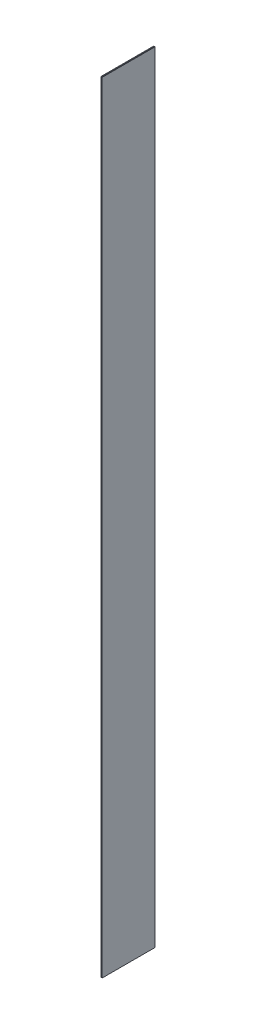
ISO-10303-21;
HEADER;
FILE_DESCRIPTION(('STEP AP214'),'2;1');
FILE_NAME('part.step','',(''),(''),'','','');
FILE_SCHEMA(('AUTOMOTIVE_DESIGN { 1 0 10303 214 1 1 1 1 }'));
ENDSEC;
DATA;
#1=APPLICATION_CONTEXT('core data for automotive mechanical design processes');
#2=APPLICATION_PROTOCOL_DEFINITION('international standard','automotive_design',2000,#1);
#3=PRODUCT_CONTEXT('',#1,'mechanical');
#4=PRODUCT('Part','Part','',(#3));
#5=PRODUCT_RELATED_PRODUCT_CATEGORY('part','',(#4));
#6=PRODUCT_DEFINITION_FORMATION('','',#4);
#7=PRODUCT_DEFINITION_CONTEXT('part definition',#1,'design');
#8=PRODUCT_DEFINITION('design','',#6,#7);
#9=PRODUCT_DEFINITION_SHAPE('','',#8);
#10=(LENGTH_UNIT() NAMED_UNIT(*) SI_UNIT(.MILLI.,.METRE.));
#11=(NAMED_UNIT(*) PLANE_ANGLE_UNIT() SI_UNIT($,.RADIAN.));
#12=(NAMED_UNIT(*) SI_UNIT($,.STERADIAN.) SOLID_ANGLE_UNIT());
#13=UNCERTAINTY_MEASURE_WITH_UNIT(LENGTH_MEASURE(1.E-05),#10,'distance_accuracy_value','');
#14=(GEOMETRIC_REPRESENTATION_CONTEXT(3) GLOBAL_UNCERTAINTY_ASSIGNED_CONTEXT((#13)) GLOBAL_UNIT_ASSIGNED_CONTEXT((#10,
#11,#12)) REPRESENTATION_CONTEXT('',''));
#15=CARTESIAN_POINT('',(0.,0.,0.));
#16=DIRECTION('',(0.,0.,1.));
#17=DIRECTION('',(1.,0.,0.));
#18=AXIS2_PLACEMENT_3D('',#15,#16,#17);
#19=CARTESIAN_POINT('',(-9.52499999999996,11255.781,381.));
#20=DIRECTION('',(1.,0.,0.));
#21=DIRECTION('',(0.,0.,-1.));
#22=AXIS2_PLACEMENT_3D('',#19,#20,#21);
#23=PLANE('',#22);
#24=DIRECTION('',(0.,-1.,0.));
#25=VECTOR('',#24,1.);
#26=CARTESIAN_POINT('',(-9.52499999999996,11255.781,381.));
#27=LINE('',#26,#25);
#28=CARTESIAN_POINT('',(-9.52499999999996,11249.781,381.));
#29=VERTEX_POINT('',#28);
#30=CARTESIAN_POINT('',(-9.52499999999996,6.00000000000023,381.));
#31=VERTEX_POINT('',#30);
#32=EDGE_CURVE('E139',#29,#31,#27,.T.);
#33=ORIENTED_EDGE('',*,*,#32,.F.);
#34=DIRECTION('',(0.,0.,-1.));
#35=VECTOR('',#34,1.);
#36=CARTESIAN_POINT('',(-9.52500000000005,11249.781,-381.));
#37=LINE('',#36,#35);
#38=CARTESIAN_POINT('',(-9.52500000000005,11249.781,-381.));
#39=VERTEX_POINT('',#38);
#40=EDGE_CURVE('E166',#29,#39,#37,.T.);
#41=ORIENTED_EDGE('',*,*,#40,.T.);
#42=DIRECTION('',(0.,-1.,0.));
#43=VECTOR('',#42,1.);
#44=CARTESIAN_POINT('',(-9.52500000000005,11255.781,-381.));
#45=LINE('',#44,#43);
#46=CARTESIAN_POINT('',(-9.52500000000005,6.00000000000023,-381.));
#47=VERTEX_POINT('',#46);
#48=EDGE_CURVE('E189',#39,#47,#45,.T.);
#49=ORIENTED_EDGE('',*,*,#48,.T.);
#50=DIRECTION('',(0.,0.,1.));
#51=VECTOR('',#50,1.);
#52=CARTESIAN_POINT('',(-9.52499999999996,6.00000000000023,381.));
#53=LINE('',#52,#51);
#54=EDGE_CURVE('E167',#47,#31,#53,.T.);
#55=ORIENTED_EDGE('',*,*,#54,.T.);
#56=EDGE_LOOP('',(#33,#41,#49,#55));
#57=FACE_BOUND('',#56,.T.);
#58=ADVANCED_FACE('F50',(#57),#23,.F.);
#59=CARTESIAN_POINT('',(9.52500000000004,11255.781,381.));
#60=DIRECTION('',(0.,0.,-1.));
#61=DIRECTION('',(-1.,0.,0.));
#62=AXIS2_PLACEMENT_3D('',#59,#60,#61);
#63=PLANE('',#62);
#64=DIRECTION('',(0.,-1.,0.));
#65=VECTOR('',#64,1.);
#66=CARTESIAN_POINT('',(9.52500000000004,11255.781,381.));
#67=LINE('',#66,#65);
#68=CARTESIAN_POINT('',(9.52500000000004,11249.781,381.));
#69=VERTEX_POINT('',#68);
#70=CARTESIAN_POINT('',(9.52500000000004,6.00000000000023,381.));
#71=VERTEX_POINT('',#70);
#72=EDGE_CURVE('E343',#69,#71,#67,.T.);
#73=ORIENTED_EDGE('',*,*,#72,.F.);
#74=DIRECTION('',(-1.,0.,0.));
#75=VECTOR('',#74,1.);
#76=CARTESIAN_POINT('',(-9.52499999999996,11249.781,381.));
#77=LINE('',#76,#75);
#78=EDGE_CURVE('E162',#69,#29,#77,.T.);
#79=ORIENTED_EDGE('',*,*,#78,.T.);
#80=ORIENTED_EDGE('',*,*,#32,.T.);
#81=DIRECTION('',(1.,0.,0.));
#82=VECTOR('',#81,1.);
#83=CARTESIAN_POINT('',(9.52500000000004,6.00000000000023,381.));
#84=LINE('',#83,#82);
#85=EDGE_CURVE('E157',#31,#71,#84,.T.);
#86=ORIENTED_EDGE('',*,*,#85,.T.);
#87=EDGE_LOOP('',(#73,#79,#80,#86));
#88=FACE_BOUND('',#87,.T.);
#89=ADVANCED_FACE('F230',(#88),#63,.F.);
#90=CARTESIAN_POINT('',(9.52500000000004,11255.781,381.));
#91=DIRECTION('',(-1.,0.,0.));
#92=DIRECTION('',(0.,0.,1.));
#93=AXIS2_PLACEMENT_3D('',#90,#91,#92);
#94=PLANE('',#93);
#95=DIRECTION('',(0.,-1.,0.));
#96=VECTOR('',#95,1.);
#97=CARTESIAN_POINT('',(9.52499999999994,11255.781,-381.));
#98=LINE('',#97,#96);
#99=CARTESIAN_POINT('',(9.52499999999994,11249.781,-381.));
#100=VERTEX_POINT('',#99);
#101=CARTESIAN_POINT('',(9.52499999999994,6.00000000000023,-381.));
#102=VERTEX_POINT('',#101);
#103=EDGE_CURVE('E336',#100,#102,#98,.T.);
#104=ORIENTED_EDGE('',*,*,#103,.F.);
#105=DIRECTION('',(0.,0.,1.));
#106=VECTOR('',#105,1.);
#107=CARTESIAN_POINT('',(9.52500000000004,11249.781,381.));
#108=LINE('',#107,#106);
#109=EDGE_CURVE('E156',#100,#69,#108,.T.);
#110=ORIENTED_EDGE('',*,*,#109,.T.);
#111=ORIENTED_EDGE('',*,*,#72,.T.);
#112=DIRECTION('',(0.,0.,-1.));
#113=VECTOR('',#112,1.);
#114=CARTESIAN_POINT('',(9.52500000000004,6.00000000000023,381.));
#115=LINE('',#114,#113);
#116=EDGE_CURVE('E153',#71,#102,#115,.T.);
#117=ORIENTED_EDGE('',*,*,#116,.T.);
#118=EDGE_LOOP('',(#104,#110,#111,#117));
#119=FACE_BOUND('',#118,.T.);
#120=ADVANCED_FACE('F233',(#119),#94,.F.);
#121=CARTESIAN_POINT('',(9.52499999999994,11255.781,-381.));
#122=DIRECTION('',(0.,0.,1.));
#123=DIRECTION('',(1.,0.,0.));
#124=AXIS2_PLACEMENT_3D('',#121,#122,#123);
#125=PLANE('',#124);
#126=ORIENTED_EDGE('',*,*,#48,.F.);
#127=DIRECTION('',(1.,0.,0.));
#128=VECTOR('',#127,1.);
#129=CARTESIAN_POINT('',(9.52499999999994,11249.781,-381.));
#130=LINE('',#129,#128);
#131=EDGE_CURVE('E124',#39,#100,#130,.T.);
#132=ORIENTED_EDGE('',*,*,#131,.T.);
#133=ORIENTED_EDGE('',*,*,#103,.T.);
#134=DIRECTION('',(-1.,0.,0.));
#135=VECTOR('',#134,1.);
#136=CARTESIAN_POINT('',(9.52499999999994,6.00000000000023,-381.));
#137=LINE('',#136,#135);
#138=EDGE_CURVE('E141',#102,#47,#137,.T.);
#139=ORIENTED_EDGE('',*,*,#138,.T.);
#140=EDGE_LOOP('',(#126,#132,#133,#139));
#141=FACE_BOUND('',#140,.T.);
#142=ADVANCED_FACE('F221',(#141),#125,.F.);
#143=CARTESIAN_POINT('',(0.,11255.781,0.));
#144=DIRECTION('',(0.,1.,0.));
#145=DIRECTION('',(0.,0.,1.));
#146=AXIS2_PLACEMENT_3D('',#143,#144,#145);
#147=PLANE('',#146);
#148=DIRECTION('',(0.,0.,-1.));
#149=VECTOR('',#148,1.);
#150=CARTESIAN_POINT('',(3.52499999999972,11255.781,-381.));
#151=LINE('',#150,#149);
#152=CARTESIAN_POINT('',(3.52499999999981,11255.781,375.));
#153=VERTEX_POINT('',#152);
#154=CARTESIAN_POINT('',(3.52499999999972,11255.781,-375.));
#155=VERTEX_POINT('',#154);
#156=EDGE_CURVE('E137',#153,#155,#151,.T.);
#157=ORIENTED_EDGE('',*,*,#156,.T.);
#158=DIRECTION('',(-1.,0.,0.));
#159=VECTOR('',#158,1.);
#160=CARTESIAN_POINT('',(-9.52500000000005,11255.781,-375.));
#161=LINE('',#160,#159);
#162=CARTESIAN_POINT('',(-3.52499999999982,11255.781,-375.));
#163=VERTEX_POINT('',#162);
#164=EDGE_CURVE('E116',#155,#163,#161,.T.);
#165=ORIENTED_EDGE('',*,*,#164,.T.);
#166=DIRECTION('',(0.,0.,1.));
#167=VECTOR('',#166,1.);
#168=CARTESIAN_POINT('',(-3.52499999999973,11255.781,381.));
#169=LINE('',#168,#167);
#170=CARTESIAN_POINT('',(-3.52499999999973,11255.781,375.));
#171=VERTEX_POINT('',#170);
#172=EDGE_CURVE('E126',#163,#171,#169,.T.);
#173=ORIENTED_EDGE('',*,*,#172,.T.);
#174=DIRECTION('',(1.,0.,0.));
#175=VECTOR('',#174,1.);
#176=CARTESIAN_POINT('',(9.52500000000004,11255.781,375.));
#177=LINE('',#176,#175);
#178=EDGE_CURVE('E133',#171,#153,#177,.T.);
#179=ORIENTED_EDGE('',*,*,#178,.T.);
#180=EDGE_LOOP('',(#157,#165,#173,#179));
#181=FACE_BOUND('',#180,.T.);
#182=ADVANCED_FACE('F140',(#181),#147,.T.);
#183=CARTESIAN_POINT('',(0.,0.,0.));
#184=DIRECTION('',(0.,1.,0.));
#185=DIRECTION('',(0.,0.,1.));
#186=AXIS2_PLACEMENT_3D('',#183,#184,#185);
#187=PLANE('',#186);
#188=DIRECTION('',(0.,0.,1.));
#189=VECTOR('',#188,1.);
#190=CARTESIAN_POINT('',(3.52499999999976,0.,0.));
#191=LINE('',#190,#189);
#192=CARTESIAN_POINT('',(3.52499999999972,0.,-375.));
#193=VERTEX_POINT('',#192);
#194=CARTESIAN_POINT('',(3.52499999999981,0.,375.));
#195=VERTEX_POINT('',#194);
#196=EDGE_CURVE('E59',#193,#195,#191,.T.);
#197=ORIENTED_EDGE('',*,*,#196,.T.);
#198=DIRECTION('',(-1.,0.,0.));
#199=VECTOR('',#198,1.);
#200=CARTESIAN_POINT('',(0.,0.,375.));
#201=LINE('',#200,#199);
#202=CARTESIAN_POINT('',(-3.52499999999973,0.,375.));
#203=VERTEX_POINT('',#202);
#204=EDGE_CURVE('E11',#195,#203,#201,.T.);
#205=ORIENTED_EDGE('',*,*,#204,.T.);
#206=DIRECTION('',(0.,0.,-1.));
#207=VECTOR('',#206,1.);
#208=CARTESIAN_POINT('',(-3.52499999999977,0.,0.));
#209=LINE('',#208,#207);
#210=CARTESIAN_POINT('',(-3.52499999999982,0.,-375.));
#211=VERTEX_POINT('',#210);
#212=EDGE_CURVE('E174',#203,#211,#209,.T.);
#213=ORIENTED_EDGE('',*,*,#212,.T.);
#214=DIRECTION('',(1.,0.,0.));
#215=VECTOR('',#214,1.);
#216=CARTESIAN_POINT('',(0.,0.,-375.));
#217=LINE('',#216,#215);
#218=EDGE_CURVE('E68',#211,#193,#217,.T.);
#219=ORIENTED_EDGE('',*,*,#218,.T.);
#220=EDGE_LOOP('',(#197,#205,#213,#219));
#221=FACE_BOUND('',#220,.T.);
#222=ADVANCED_FACE('F213',(#221),#187,.F.);
#223=CARTESIAN_POINT('',(0.,11255.781,375.));
#224=DIRECTION('',(0.,0.707106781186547,0.707106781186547));
#225=DIRECTION('',(-1.,0.,0.));
#226=AXIS2_PLACEMENT_3D('',#223,#224,#225);
#227=PLANE('',#226);
#228=DIRECTION('',(0.577350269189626,0.577350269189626,-0.577350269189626));
#229=VECTOR('',#228,1.);
#230=CARTESIAN_POINT('',(121.475,11380.781,250.));
#231=LINE('',#230,#229);
#232=EDGE_CURVE('E132',#29,#171,#231,.T.);
#233=ORIENTED_EDGE('',*,*,#232,.F.);
#234=ORIENTED_EDGE('',*,*,#78,.F.);
#235=DIRECTION('',(-0.577350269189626,0.577350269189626,-0.577350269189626));
#236=VECTOR('',#235,1.);
#237=CARTESIAN_POINT('',(2.34999999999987,11256.956,373.825));
#238=LINE('',#237,#236);
#239=EDGE_CURVE('E181',#153,#69,#238,.F.);
#240=ORIENTED_EDGE('',*,*,#239,.F.);
#241=ORIENTED_EDGE('',*,*,#178,.F.);
#242=EDGE_LOOP('',(#233,#234,#240,#241));
#243=FACE_BOUND('',#242,.T.);
#244=ADVANCED_FACE('F214',(#243),#227,.T.);
#245=CARTESIAN_POINT('',(3.52499999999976,11255.781,0.));
#246=DIRECTION('',(0.707106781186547,0.707106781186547,0.));
#247=DIRECTION('',(0.,0.,1.));
#248=AXIS2_PLACEMENT_3D('',#245,#246,#247);
#249=PLANE('',#248);
#250=ORIENTED_EDGE('',*,*,#239,.T.);
#251=ORIENTED_EDGE('',*,*,#109,.F.);
#252=DIRECTION('',(-0.577350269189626,0.577350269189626,0.577350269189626));
#253=VECTOR('',#252,1.);
#254=CARTESIAN_POINT('',(-121.475,11380.781,-250.));
#255=LINE('',#254,#253);
#256=EDGE_CURVE('E122',#155,#100,#255,.F.);
#257=ORIENTED_EDGE('',*,*,#256,.F.);
#258=ORIENTED_EDGE('',*,*,#156,.F.);
#259=EDGE_LOOP('',(#250,#251,#257,#258));
#260=FACE_BOUND('',#259,.T.);
#261=ADVANCED_FACE('F222',(#260),#249,.T.);
#262=CARTESIAN_POINT('',(-3.52499999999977,11255.781,0.));
#263=DIRECTION('',(-0.707106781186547,0.707106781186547,0.));
#264=DIRECTION('',(0.,0.,-1.));
#265=AXIS2_PLACEMENT_3D('',#262,#263,#264);
#266=PLANE('',#265);
#267=ORIENTED_EDGE('',*,*,#232,.T.);
#268=ORIENTED_EDGE('',*,*,#172,.F.);
#269=DIRECTION('',(-0.577350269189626,-0.577350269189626,-0.577350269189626));
#270=VECTOR('',#269,1.);
#271=CARTESIAN_POINT('',(121.475,11380.781,-250.));
#272=LINE('',#271,#270);
#273=EDGE_CURVE('E113',#39,#163,#272,.F.);
#274=ORIENTED_EDGE('',*,*,#273,.F.);
#275=ORIENTED_EDGE('',*,*,#40,.F.);
#276=EDGE_LOOP('',(#267,#268,#274,#275));
#277=FACE_BOUND('',#276,.T.);
#278=ADVANCED_FACE('F129',(#277),#266,.T.);
#279=CARTESIAN_POINT('',(0.,11255.781,-375.));
#280=DIRECTION('',(0.,0.707106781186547,-0.707106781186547));
#281=DIRECTION('',(1.,0.,0.));
#282=AXIS2_PLACEMENT_3D('',#279,#280,#281);
#283=PLANE('',#282);
#284=ORIENTED_EDGE('',*,*,#256,.T.);
#285=ORIENTED_EDGE('',*,*,#131,.F.);
#286=ORIENTED_EDGE('',*,*,#273,.T.);
#287=ORIENTED_EDGE('',*,*,#164,.F.);
#288=EDGE_LOOP('',(#284,#285,#286,#287));
#289=FACE_BOUND('',#288,.T.);
#290=ADVANCED_FACE('F119',(#289),#283,.T.);
#291=CARTESIAN_POINT('',(9.52499999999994,6.00000000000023,-381.));
#292=DIRECTION('',(0.,0.707106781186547,0.707106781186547));
#293=DIRECTION('',(-1.,0.,0.));
#294=AXIS2_PLACEMENT_3D('',#291,#292,#293);
#295=PLANE('',#294);
#296=DIRECTION('',(-0.577350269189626,-0.577350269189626,0.577350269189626));
#297=VECTOR('',#296,1.);
#298=CARTESIAN_POINT('',(9.52499999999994,6.00000000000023,-381.));
#299=LINE('',#298,#297);
#300=EDGE_CURVE('E195',#193,#102,#299,.F.);
#301=ORIENTED_EDGE('',*,*,#300,.F.);
#302=ORIENTED_EDGE('',*,*,#218,.F.);
#303=DIRECTION('',(0.577350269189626,-0.577350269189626,0.577350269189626));
#304=VECTOR('',#303,1.);
#305=CARTESIAN_POINT('',(244.475,-248.,-127.));
#306=LINE('',#305,#304);
#307=EDGE_CURVE('E55',#47,#211,#306,.T.);
#308=ORIENTED_EDGE('',*,*,#307,.F.);
#309=ORIENTED_EDGE('',*,*,#138,.F.);
#310=EDGE_LOOP('',(#301,#302,#308,#309));
#311=FACE_BOUND('',#310,.T.);
#312=ADVANCED_FACE('F49',(#311),#295,.F.);
#313=CARTESIAN_POINT('',(-9.52499999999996,6.00000000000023,381.));
#314=DIRECTION('',(0.707106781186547,0.707106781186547,0.));
#315=DIRECTION('',(0.,0.,1.));
#316=AXIS2_PLACEMENT_3D('',#313,#314,#315);
#317=PLANE('',#316);
#318=ORIENTED_EDGE('',*,*,#307,.T.);
#319=ORIENTED_EDGE('',*,*,#212,.F.);
#320=DIRECTION('',(-0.577350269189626,0.577350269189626,0.577350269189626));
#321=VECTOR('',#320,1.);
#322=CARTESIAN_POINT('',(-9.52499999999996,6.00000000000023,381.));
#323=LINE('',#322,#321);
#324=EDGE_CURVE('E194',#31,#203,#323,.F.);
#325=ORIENTED_EDGE('',*,*,#324,.F.);
#326=ORIENTED_EDGE('',*,*,#54,.F.);
#327=EDGE_LOOP('',(#318,#319,#325,#326));
#328=FACE_BOUND('',#327,.T.);
#329=ADVANCED_FACE('F204',(#328),#317,.F.);
#330=CARTESIAN_POINT('',(9.52500000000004,6.00000000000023,381.));
#331=DIRECTION('',(-0.707106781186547,0.707106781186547,0.));
#332=DIRECTION('',(0.,0.,-1.));
#333=AXIS2_PLACEMENT_3D('',#330,#331,#332);
#334=PLANE('',#333);
#335=ORIENTED_EDGE('',*,*,#300,.T.);
#336=ORIENTED_EDGE('',*,*,#116,.F.);
#337=DIRECTION('',(-0.577350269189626,-0.577350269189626,-0.577350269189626));
#338=VECTOR('',#337,1.);
#339=CARTESIAN_POINT('',(9.52500000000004,6.00000000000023,381.));
#340=LINE('',#339,#338);
#341=EDGE_CURVE('E190',#195,#71,#340,.F.);
#342=ORIENTED_EDGE('',*,*,#341,.F.);
#343=ORIENTED_EDGE('',*,*,#196,.F.);
#344=EDGE_LOOP('',(#335,#336,#342,#343));
#345=FACE_BOUND('',#344,.T.);
#346=ADVANCED_FACE('F207',(#345),#334,.F.);
#347=CARTESIAN_POINT('',(9.52500000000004,6.00000000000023,381.));
#348=DIRECTION('',(0.,0.707106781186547,-0.707106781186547));
#349=DIRECTION('',(1.,0.,0.));
#350=AXIS2_PLACEMENT_3D('',#347,#348,#349);
#351=PLANE('',#350);
#352=ORIENTED_EDGE('',*,*,#324,.T.);
#353=ORIENTED_EDGE('',*,*,#204,.F.);
#354=ORIENTED_EDGE('',*,*,#341,.T.);
#355=ORIENTED_EDGE('',*,*,#85,.F.);
#356=EDGE_LOOP('',(#352,#353,#354,#355));
#357=FACE_BOUND('',#356,.T.);
#358=ADVANCED_FACE('F215',(#357),#351,.F.);
#359=CLOSED_SHELL('',(#58,#89,#120,#142,#182,#222,#244,#261,#278,#290,#312,#329,#346,#358));
#360=MANIFOLD_SOLID_BREP('B2',#359);
#361=ADVANCED_BREP_SHAPE_REPRESENTATION('',(#18,#360),#14);
#362=SHAPE_DEFINITION_REPRESENTATION(#9,#361);
ENDSEC;
END-ISO-10303-21;
